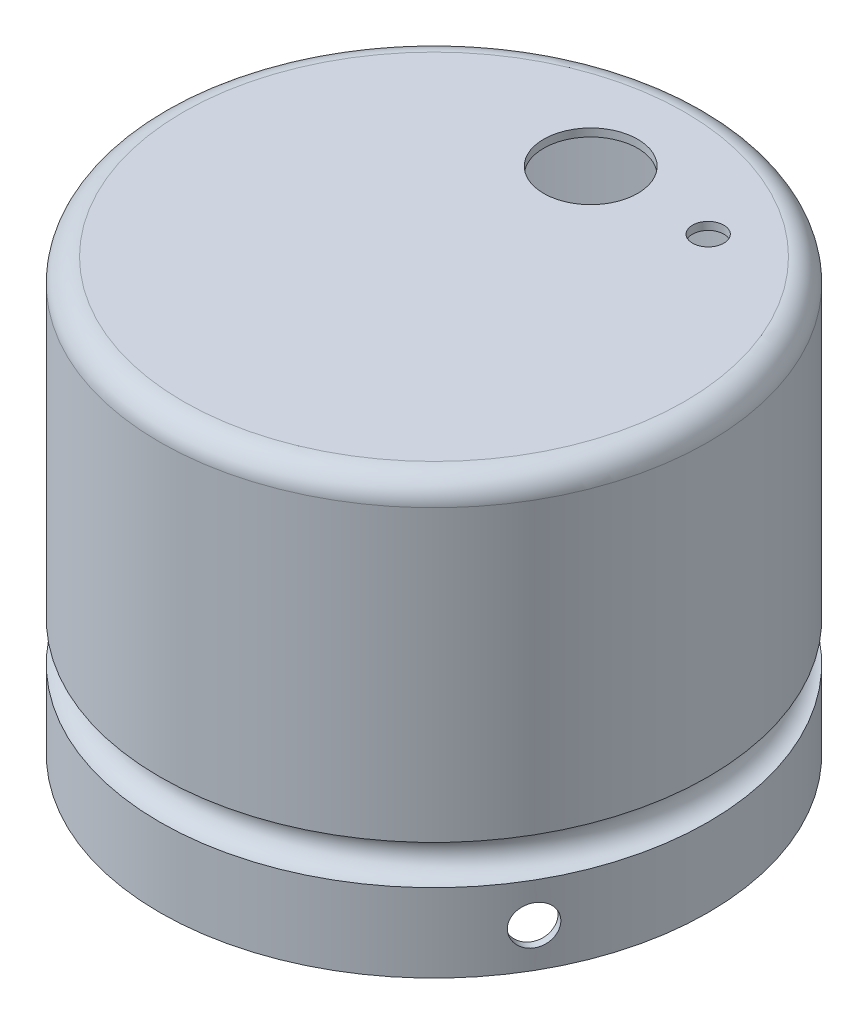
from build123d import *

# Parameters (mm, degrees)
FILLET1_R               = 3
SHELL2_T                = -1
SKETCH2_R               = 6
SKETCH2_R_2             = 2
CUT_EXTRUDE1_DEPTH      = 1
CUT_EXTRUDE3_REACH      = 113.953
CUT_EXTRUDE3_END_RADIUS = 34
SKETCH8_R               = 2.5
CIRPATTERN1_COUNT       = 3


with BuildPart() as part:
    # Sketch1 → Revolve1 (revolve)
    with BuildSketch(Plane.XY, mode=Mode.PRIVATE) as revolve1_sk:
        with BuildLine():
            Line((0, 80.052571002), (-35, 80.052571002))
            Line((-35, 80.052571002), (-35, 40.052571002))
            ThreePointArc((-35, 40.052571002), (-32.5, 37.552571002), (-35, 35.052571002))
            Line((-35, 35.052571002), (-35, 25.052571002))
            Line((-35, 25.052571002), (0, 25.052571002))
            Line((0, 25.052571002), (0, 80.052571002))
        make_face()
    revolve(revolve1_sk.sketch.rotate(Axis((0, 99.411581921, 0), (0, -1, 0)), 270), axis=Axis((0, 99.411581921, 0), (0, -1, 0)))

    # Fillet1
    fillet1_edges = [part.edges().sort_by_distance(p)[0] for p in [
        (0, 80.052571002, -35),
    ]]
    fillet(fillet1_edges, radius=FILLET1_R)

    # Shell2
    shell2_openings = [part.faces().sort_by_distance(p)[0] for p in [
        (0, 25.052571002, 0),
    ]]
    offset(amount=SHELL2_T, openings=shell2_openings, kind=Kind.INTERSECTION)

    # Sketch2 → Cut-Extrude1 (cut)
    with BuildSketch(Plane(origin=(0, 80.052571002, 0), x_dir=(-1, 0, 0), z_dir=(0, 1, 0))):
        with Locations(Location((0, -20, 0), (0, 0, 90))):
            Circle(SKETCH2_R)
        with Locations(Location((-15, -20, 0), (0, 0, 90))):
            Circle(SKETCH2_R_2)
    extrude(amount=-CUT_EXTRUDE1_DEPTH, mode=Mode.SUBTRACT)

    # Cut-Extrude3: up to this cylinder (the profile starts outside it)
    cut_extrude3_end = Plane(origin=(0, 30.052571, 0), z_dir=(0, 1, 0)) * Cylinder(CUT_EXTRUDE3_END_RADIUS, 296.906, mode=Mode.PRIVATE)
    # Sketch8 → Cut-Extrude3 (cut, up to the surface)
    with BuildSketch(Plane.XY.offset(-35), mode=Mode.PRIVATE) as cut_extrude3_sk1:
        with Locations(Location((0, 30.052571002, 0), (0, 0, 180))):
            Circle(SKETCH8_R)
    cut_extrude3_tool1 = extrude(cut_extrude3_sk1.sketch, amount=CUT_EXTRUDE3_REACH, mode=Mode.PRIVATE) - cut_extrude3_end
    cut_extrude3 = cut_extrude3_tool1.solids().sort_by_distance((0, 30.052571, -35))[0]
    add(cut_extrude3, mode=Mode.SUBTRACT)

    # CirPattern1: Cut-Extrude3 ×3 about axis
    cirpattern1_axis = Axis((0, 99.411581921, 0), (0, -1, 0))
    for i in range(1, CIRPATTERN1_COUNT):
        add(cut_extrude3.rotate(cirpattern1_axis, i * 360 / CIRPATTERN1_COUNT), mode=Mode.SUBTRACT)


solid = part.part
